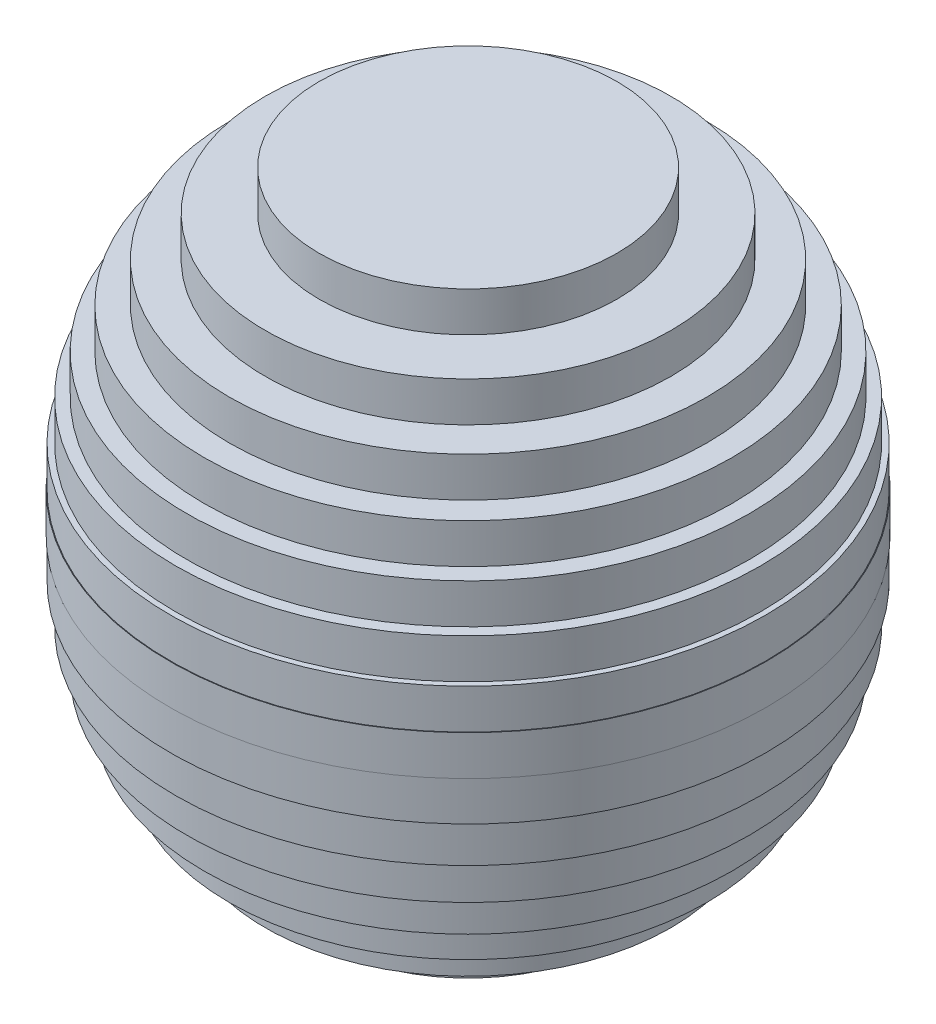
from build123d import *


with BuildPart() as part:
    # Sketch3 → Revolve3 (revolve)
    with BuildSketch(Plane.XY):
        Polygon((37.5, 2.5), (37.5, -2.5), (37.416573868, -2.5), (37.416573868, -7.5), (36.742346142, -7.5), (36.742346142, -12.5), (35.355339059, -12.5), (35.355339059, -17.5), (33.166247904, -17.5), (33.166247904, -22.5), (30, -22.5), (30, -27.5), (25.495097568, -27.5), (25.495097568, -32.5), (18.708286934, -32.5), (18.708286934, -37.5), (0, -37.5), (0, 37.5), (18.708286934, 37.5), (18.708286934, 32.5), (25.495097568, 32.5), (25.495097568, 27.5), (30, 27.5), (30, 22.5), (33.166247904, 22.5), (33.166247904, 17.5), (35.355339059, 17.5), (35.355339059, 12.5), (36.742346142, 12.5), (36.742346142, 7.5), (37.416573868, 7.5), (37.416573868, 2.5), align=None)
    revolve(axis=Axis((0, -37.5, 0), (0, 1, 0)))


solid = part.part
